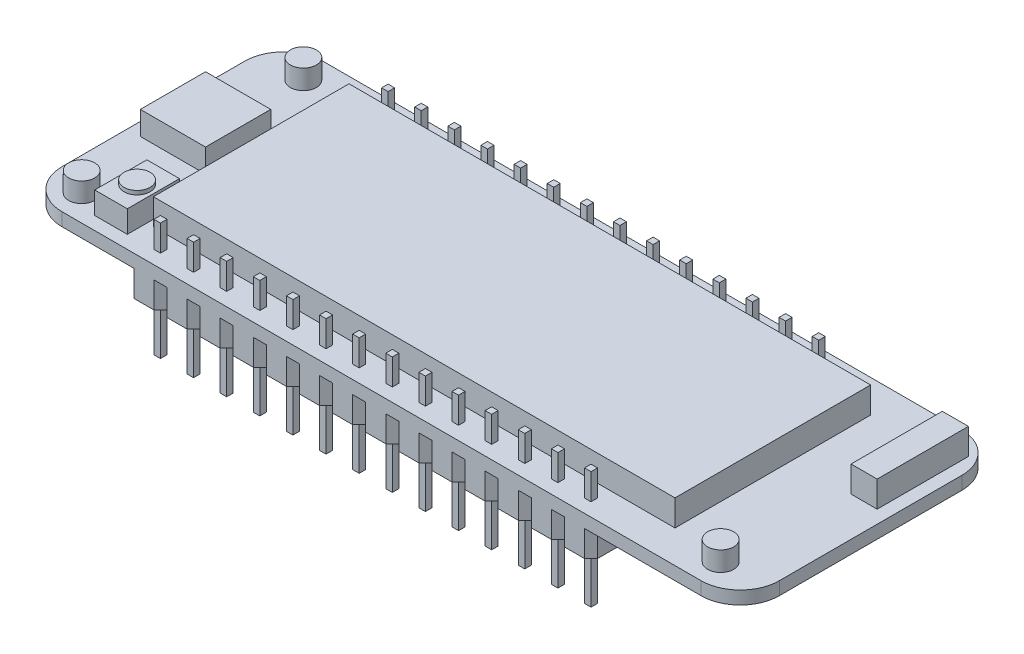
from build123d import *

# Parameters (mm, degrees)
BOARD_DEPTH              = 1
SKETCH2_W                = 40
SKETCH2_H                = 15
LOPY4_CHIP_DEPTH         = 2
SKETCH3_W                = 2
SKETCH3_H                = 7
ANTENNA_DEPTH            = 2
SKETCH4_W                = 5
SKETCH4_H                = 5
LED_DEPTH                = 1.8
SKETCH5_W                = 2.5
SKETCH5_H                = 4
BUTTON_BASE_DEPTH        = 1.7
SKETCH6_R                = 1
BUTTON_DEPTH             = 0.3
SKETCH7_R                = 1
LORA_ANTENNAE_DEPTH      = 1.5
HEADER_BLOCKS_DEPTH      = 2
BOSS_EXTRUDE9_DEPTH      = 2
BOSS_EXTRUDE9_DEPTH_BACK = 7
SKETCH10_W               = 0.5
SKETCH10_H               = 0.5


with BuildPart() as part:
    # Sketch1 → Board (new body)
    with BuildSketch(Plane(origin=(0, 0, 0), x_dir=(1, 0, 0), z_dir=(0, 1, 0))):
        with BuildLine():
            Line((3, 0), (52, 0))
            ThreePointArc((52, 0), (54.121320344, 0.878679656), (55, 3))
            Line((55, 3), (55, 17))
            ThreePointArc((55, 17), (54.121320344, 19.121320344), (52, 20))
            Line((52, 20), (3, 20))
            ThreePointArc((3, 20), (0.878679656, 19.121320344), (0, 17))
            Line((0, 17), (0, 3))
            ThreePointArc((0, 3), (0.878679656, 0.878679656), (3, 0))
        make_face()
    extrude(amount=BOARD_DEPTH)

    # Sketch2 → LoPy4 chip (add)
    with BuildSketch(Plane(origin=(0, 1, 0), x_dir=(1, 0, 0), z_dir=(0, 1, 0))):
        with Locations((27.5, 10)):
            Rectangle(SKETCH2_W, SKETCH2_H)
    extrude(amount=LOPY4_CHIP_DEPTH)

    # Sketch3 → Antenna (add)
    with BuildSketch(Plane(origin=(0, 1, 0), x_dir=(1, 0, 0), z_dir=(0, 1, 0))):
        with Locations((53, 15)):
            Rectangle(SKETCH3_W, SKETCH3_H)
    extrude(amount=ANTENNA_DEPTH)

    # Sketch4 → LED (add)
    with BuildSketch(Plane(origin=(0, 1, 0), x_dir=(1, 0, 0), z_dir=(0, 1, 0))):
        with Locations((3.5, 10.5)):
            Rectangle(SKETCH4_W, SKETCH4_H)
    extrude(amount=LED_DEPTH)

    # Sketch5 → Button base (add)
    with BuildSketch(Plane(origin=(0, 1, 0), x_dir=(1, 0, 0), z_dir=(0, 1, 0))):
        with Locations((5.75, 3)):
            Rectangle(SKETCH5_W, SKETCH5_H)
    extrude(amount=BUTTON_BASE_DEPTH)

    # Sketch6 → Button (add)
    with BuildSketch(Plane(origin=(0, 2.7, 0), x_dir=(1, 0, 0), z_dir=(0, 1, 0))):
        with Locations(Location((5.75, 3, 0), (0, 0, 270))):
            Circle(SKETCH6_R)
    extrude(amount=BUTTON_DEPTH)

    # Sketch7 → LoRa antennae (add)
    with BuildSketch(Plane(origin=(0, 1, 0), x_dir=(1, 0, 0), z_dir=(0, 1, 0))):
        with Locations(Location((3.5, 18, 0), (0, 0, 90))):
            Circle(SKETCH7_R)
        with Locations(Location((2.5, 2, 0), (0, 0, 90))):
            Circle(SKETCH7_R)
        with Locations(Location((51.5, 2, 0), (0, 0, 90))):
            Circle(SKETCH7_R)
    extrude(amount=LORA_ANTENNAE_DEPTH)

    # Sketch9 → Header blocks (add)
    with BuildSketch(Plane(origin=(0, 0, 0), x_dir=(-1, 0, 0), z_dir=(0, -1, 0))):
        Polygon((-8.5, 0), (-8, 0.5), (-8, 2.04), (-8.5, 2.54), (-10.04, 2.54), (-10.54, 2.04), (-11.04, 2.54), (-12.58, 2.54), (-13.08, 2.04), (-13.58, 2.54), (-15.12, 2.54), (-15.62, 2.04), (-16.12, 2.54), (-17.66, 2.54), (-18.16, 2.04), (-18.66, 2.54), (-20.2, 2.54), (-20.7, 2.04), (-21.2, 2.54), (-22.74, 2.54), (-23.24, 2.04), (-23.74, 2.54), (-25.28, 2.54), (-25.78, 2.04), (-26.28, 2.54), (-27.82, 2.54), (-28.32, 2.04), (-28.82, 2.54), (-30.36, 2.54), (-30.86, 2.04), (-31.36, 2.54), (-32.9, 2.54), (-33.4, 2.04), (-33.9, 2.54), (-35.44, 2.54), (-35.94, 2.04), (-36.44, 2.54), (-37.98, 2.54), (-38.48, 2.04), (-38.98, 2.54), (-40.52, 2.54), (-41.02, 2.04), (-41.52, 2.54), (-43.06, 2.54), (-43.56, 2.04), (-43.56, 0.5), (-43.06, 0), (-41.52, 0), (-41.02, 0.5), (-40.52, 0), (-38.98, 0), (-38.48, 0.5), (-37.98, 0), (-36.44, 0), (-35.94, 0.5), (-35.44, 0), (-33.9, 0), (-33.4, 0.5), (-32.9, 0), (-31.36, 0), (-30.86, 0.5), (-30.36, 0), (-28.82, 0), (-28.32, 0.5), (-27.82, 0), (-26.28, 0), (-25.78, 0.5), (-25.28, 0), (-23.74, 0), (-23.24, 0.5), (-22.74, 0), (-21.2, 0), (-20.7, 0.5), (-20.2, 0), (-18.66, 0), (-18.16, 0.5), (-17.66, 0), (-16.12, 0), (-15.62, 0.5), (-15.12, 0), (-13.58, 0), (-13.08, 0.5), (-12.58, 0), (-11.04, 0), (-10.54, 0.5), (-10.04, 0), align=None)
        Polygon((-11.04, 17.46), (-10.54, 17.96), (-10.04, 17.46), (-8.5, 17.46), (-8, 17.96), (-8, 19.5), (-8.5, 20), (-10.04, 20), (-10.54, 19.5), (-11.04, 20), (-12.58, 20), (-13.08, 19.5), (-13.58, 20), (-15.12, 20), (-15.62, 19.5), (-16.12, 20), (-17.66, 20), (-18.16, 19.5), (-18.66, 20), (-20.2, 20), (-20.7, 19.5), (-21.2, 20), (-22.74, 20), (-23.24, 19.5), (-23.74, 20), (-25.28, 20), (-25.78, 19.5), (-26.28, 20), (-27.82, 20), (-28.32, 19.5), (-28.82, 20), (-30.36, 20), (-30.86, 19.5), (-31.36, 20), (-32.9, 20), (-33.4, 19.5), (-33.9, 20), (-35.44, 20), (-35.94, 19.5), (-36.44, 20), (-37.98, 20), (-38.48, 19.5), (-38.98, 20), (-40.52, 20), (-41.02, 19.5), (-41.52, 20), (-43.06, 20), (-43.56, 19.5), (-43.56, 17.96), (-43.06, 17.46), (-41.52, 17.46), (-41.02, 17.96), (-40.52, 17.46), (-38.98, 17.46), (-38.48, 17.96), (-37.98, 17.46), (-36.44, 17.46), (-35.94, 17.96), (-35.44, 17.46), (-33.9, 17.46), (-33.4, 17.96), (-32.9, 17.46), (-31.36, 17.46), (-30.86, 17.96), (-30.36, 17.46), (-28.82, 17.46), (-28.32, 17.96), (-27.82, 17.46), (-26.28, 17.46), (-25.78, 17.96), (-25.28, 17.46), (-23.74, 17.46), (-23.24, 17.96), (-22.74, 17.46), (-21.2, 17.46), (-20.7, 17.96), (-20.2, 17.46), (-18.66, 17.46), (-18.16, 17.96), (-17.66, 17.46), (-16.12, 17.46), (-15.62, 17.96), (-15.12, 17.46), (-13.58, 17.46), (-13.08, 17.96), (-12.58, 17.46), align=None)
    extrude(amount=HEADER_BLOCKS_DEPTH)

    # Sketch10 → Boss-Extrude9 (add, two sides: drawn at the far end of the back side and taken through both)
    with BuildSketch(Plane(origin=(0, 1, 0), x_dir=(1, 0, 0), z_dir=(0, 1, 0)).offset(-BOSS_EXTRUDE9_DEPTH_BACK)):
        with Locations((9.27, 1.27)):
            Rectangle(SKETCH10_W, SKETCH10_H)
        with Locations((11.81, 1.27)):
            Rectangle(SKETCH10_W, SKETCH10_H)
        with Locations((14.35, 1.27)):
            Rectangle(SKETCH10_W, SKETCH10_H)
        with Locations((16.89, 1.27)):
            Rectangle(SKETCH10_W, SKETCH10_H)
        with Locations((19.43, 1.27)):
            Rectangle(SKETCH10_W, SKETCH10_H)
        with Locations((21.97, 1.27)):
            Rectangle(SKETCH10_W, SKETCH10_H)
        with Locations((24.51, 1.27)):
            Rectangle(SKETCH10_W, SKETCH10_H)
        with Locations((27.05, 1.27)):
            Rectangle(SKETCH10_W, SKETCH10_H)
        with Locations((29.59, 1.27)):
            Rectangle(SKETCH10_W, SKETCH10_H)
        with Locations((32.13, 1.27)):
            Rectangle(SKETCH10_W, SKETCH10_H)
        with Locations((34.67, 1.27)):
            Rectangle(SKETCH10_W, SKETCH10_H)
        with Locations((37.21, 1.27)):
            Rectangle(SKETCH10_W, SKETCH10_H)
        with Locations((39.75, 1.27)):
            Rectangle(SKETCH10_W, SKETCH10_H)
        with Locations((42.29, 1.27)):
            Rectangle(SKETCH10_W, SKETCH10_H)
        with Locations((11.81, 18.73)):
            Rectangle(SKETCH10_W, SKETCH10_H)
        with Locations((14.35, 18.73)):
            Rectangle(SKETCH10_W, SKETCH10_H)
        with Locations((16.89, 18.73)):
            Rectangle(SKETCH10_W, SKETCH10_H)
        with Locations((19.43, 18.73)):
            Rectangle(SKETCH10_W, SKETCH10_H)
        with Locations((21.97, 18.73)):
            Rectangle(SKETCH10_W, SKETCH10_H)
        with Locations((24.51, 18.73)):
            Rectangle(SKETCH10_W, SKETCH10_H)
        with Locations((27.05, 18.73)):
            Rectangle(SKETCH10_W, SKETCH10_H)
        with Locations((29.59, 18.73)):
            Rectangle(SKETCH10_W, SKETCH10_H)
        with Locations((32.13, 18.73)):
            Rectangle(SKETCH10_W, SKETCH10_H)
        with Locations((34.67, 18.73)):
            Rectangle(SKETCH10_W, SKETCH10_H)
        with Locations((37.21, 18.73)):
            Rectangle(SKETCH10_W, SKETCH10_H)
        with Locations((39.75, 18.73)):
            Rectangle(SKETCH10_W, SKETCH10_H)
        with Locations((42.29, 18.73)):
            Rectangle(SKETCH10_W, SKETCH10_H)
        with Locations((9.27, 18.73)):
            Rectangle(SKETCH10_W, SKETCH10_H)
    extrude(amount=BOSS_EXTRUDE9_DEPTH + BOSS_EXTRUDE9_DEPTH_BACK)


solid = part.part
